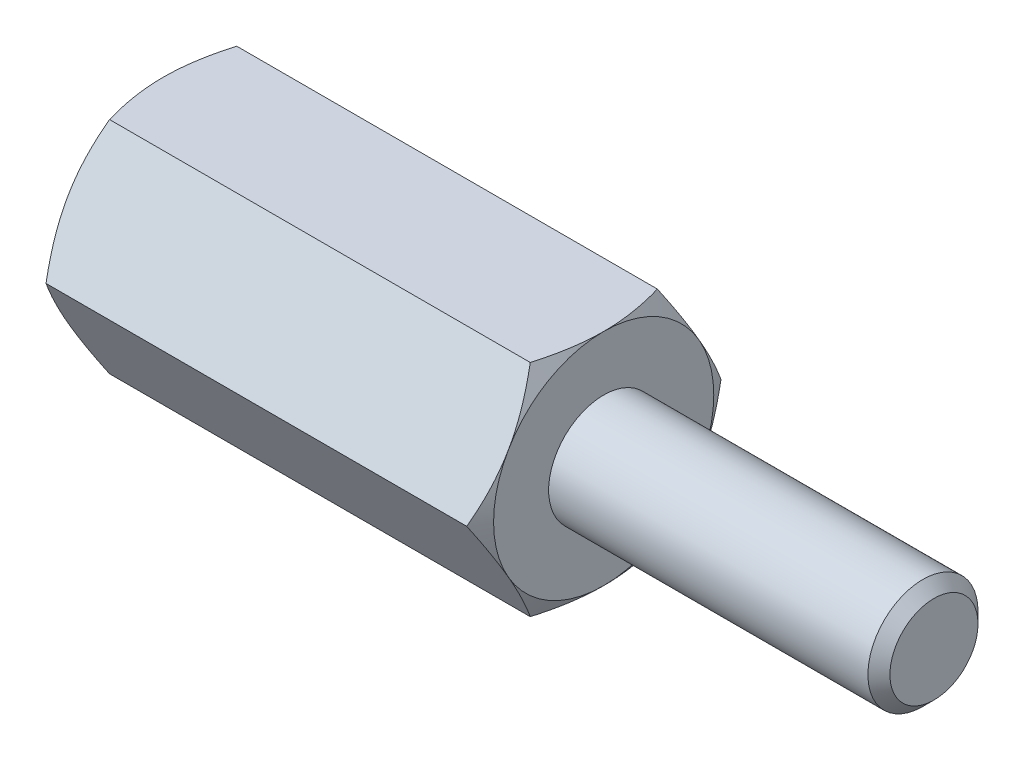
ISO-10303-21;
HEADER;
FILE_DESCRIPTION(('STEP AP214'),'2;1');
FILE_NAME('part.step','',(''),(''),'','','');
FILE_SCHEMA(('AUTOMOTIVE_DESIGN { 1 0 10303 214 1 1 1 1 }'));
ENDSEC;
DATA;
#1=APPLICATION_CONTEXT('core data for automotive mechanical design processes');
#2=APPLICATION_PROTOCOL_DEFINITION('international standard','automotive_design',2000,#1);
#3=PRODUCT_CONTEXT('',#1,'mechanical');
#4=PRODUCT('Part','Part','',(#3));
#5=PRODUCT_RELATED_PRODUCT_CATEGORY('part','',(#4));
#6=PRODUCT_DEFINITION_FORMATION('','',#4);
#7=PRODUCT_DEFINITION_CONTEXT('part definition',#1,'design');
#8=PRODUCT_DEFINITION('design','',#6,#7);
#9=PRODUCT_DEFINITION_SHAPE('','',#8);
#10=(LENGTH_UNIT() NAMED_UNIT(*) SI_UNIT(.MILLI.,.METRE.));
#11=(NAMED_UNIT(*) PLANE_ANGLE_UNIT() SI_UNIT($,.RADIAN.));
#12=(NAMED_UNIT(*) SI_UNIT($,.STERADIAN.) SOLID_ANGLE_UNIT());
#13=UNCERTAINTY_MEASURE_WITH_UNIT(LENGTH_MEASURE(1.E-05),#10,'distance_accuracy_value','');
#14=(GEOMETRIC_REPRESENTATION_CONTEXT(3) GLOBAL_UNCERTAINTY_ASSIGNED_CONTEXT((#13)) GLOBAL_UNIT_ASSIGNED_CONTEXT((#10,
#11,#12)) REPRESENTATION_CONTEXT('',''));
#15=CARTESIAN_POINT('',(0.,0.,0.));
#16=DIRECTION('',(0.,0.,1.));
#17=DIRECTION('',(1.,0.,0.));
#18=AXIS2_PLACEMENT_3D('',#15,#16,#17);
#19=CARTESIAN_POINT('',(4.,2.,-1.15470053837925));
#20=DIRECTION('',(1.,0.,0.));
#21=DIRECTION('',(0.,0.,-1.));
#22=AXIS2_PLACEMENT_3D('',#19,#20,#21);
#23=PLANE('',#22);
#24=CARTESIAN_POINT('',(4.,0.,0.));
#25=DIRECTION('',(1.,0.,0.));
#26=DIRECTION('',(0.,0.,-1.));
#27=AXIS2_PLACEMENT_3D('',#24,#25,#26);
#28=CIRCLE('',#27,2.);
#29=CARTESIAN_POINT('',(4.,-1.,-1.73205080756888));
#30=VERTEX_POINT('',#29);
#31=CARTESIAN_POINT('',(4.,1.,-1.73205080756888));
#32=VERTEX_POINT('',#31);
#33=EDGE_CURVE('E288',#30,#32,#28,.T.);
#34=ORIENTED_EDGE('',*,*,#33,.T.);
#35=CARTESIAN_POINT('',(4.,2.,0.));
#36=VERTEX_POINT('',#35);
#37=EDGE_CURVE('E53',#32,#36,#28,.T.);
#38=ORIENTED_EDGE('',*,*,#37,.T.);
#39=CARTESIAN_POINT('',(4.,1.,1.73205080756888));
#40=VERTEX_POINT('',#39);
#41=EDGE_CURVE('E297',#36,#40,#28,.T.);
#42=ORIENTED_EDGE('',*,*,#41,.T.);
#43=CARTESIAN_POINT('',(4.,-1.,1.73205080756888));
#44=VERTEX_POINT('',#43);
#45=EDGE_CURVE('E303',#40,#44,#28,.T.);
#46=ORIENTED_EDGE('',*,*,#45,.T.);
#47=CARTESIAN_POINT('',(4.,0.,0.));
#48=DIRECTION('',(-1.,0.,0.));
#49=DIRECTION('',(0.,-1.,0.));
#50=AXIS2_PLACEMENT_3D('',#47,#48,#49);
#51=CIRCLE('',#50,2.);
#52=CARTESIAN_POINT('',(4.,-2.,0.));
#53=VERTEX_POINT('',#52);
#54=EDGE_CURVE('E193',#53,#44,#51,.T.);
#55=ORIENTED_EDGE('',*,*,#54,.F.);
#56=EDGE_CURVE('E61',#53,#30,#28,.T.);
#57=ORIENTED_EDGE('',*,*,#56,.T.);
#58=EDGE_LOOP('',(#34,#38,#42,#46,#55,#57));
#59=FACE_BOUND('',#58,.T.);
#60=CARTESIAN_POINT('',(4.,0.,0.));
#61=DIRECTION('',(1.,0.,0.));
#62=DIRECTION('',(0.,0.,-1.));
#63=AXIS2_PLACEMENT_3D('',#60,#61,#62);
#64=CIRCLE('',#63,1.);
#65=CARTESIAN_POINT('',(4.,0.,-1.));
#66=VERTEX_POINT('',#65);
#67=EDGE_CURVE('E421',#66,#66,#64,.T.);
#68=ORIENTED_EDGE('',*,*,#67,.F.);
#69=EDGE_LOOP('',(#68));
#70=FACE_BOUND('',#69,.T.);
#71=ADVANCED_FACE('F37',(#59,#70),#23,.T.);
#72=CARTESIAN_POINT('',(4.,0.,-2.3094010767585));
#73=DIRECTION('',(0.,-0.5,0.866025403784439));
#74=DIRECTION('',(0.,-0.866025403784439,-0.5));
#75=AXIS2_PLACEMENT_3D('',#72,#73,#74);
#76=PLANE('',#75);
#77=CARTESIAN_POINT('',(3.8213005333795,-0.000200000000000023,-2.30951654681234));
#78=CARTESIAN_POINT('',(3.85061046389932,0.0876912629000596,-2.25877250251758));
#79=CARTESIAN_POINT('',(3.87726714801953,0.176341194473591,-2.20759044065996));
#80=CARTESIAN_POINT('',(3.92379750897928,0.355176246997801,-2.10433997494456));
#81=CARTESIAN_POINT('',(3.94365472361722,0.445364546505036,-2.05226973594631));
#82=CARTESIAN_POINT('',(3.97456653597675,0.624623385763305,-1.94877459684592));
#83=CARTESIAN_POINT('',(3.98582684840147,0.713666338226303,-1.89736562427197));
#84=CARTESIAN_POINT('',(3.99927133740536,0.892171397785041,-1.79430568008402));
#85=CARTESIAN_POINT('',(4.00146664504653,0.981632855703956,-1.74265508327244));
#86=CARTESIAN_POINT('',(3.99690901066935,1.1488083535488,-1.64613626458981));
#87=CARTESIAN_POINT('',(3.99127512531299,1.22654737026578,-1.60125362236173));
#88=CARTESIAN_POINT('',(3.97341610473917,1.38151891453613,-1.51178075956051));
#89=CARTESIAN_POINT('',(3.96118486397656,1.4587509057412,-1.46719084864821));
#90=CARTESIAN_POINT('',(3.93060656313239,1.6140421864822,-1.37753338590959));
#91=CARTESIAN_POINT('',(3.91212983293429,1.69208181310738,-1.33247718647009));
#92=CARTESIAN_POINT('',(3.87019448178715,1.84699686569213,-1.24303693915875));
#93=CARTESIAN_POINT('',(3.84674571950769,1.92387427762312,-1.1986517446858));
#94=CARTESIAN_POINT('',(3.8213005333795,2.0002,-1.15458506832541));
#95=B_SPLINE_CURVE_WITH_KNOTS('',3,(#77,#78,#79,#80,#81,#82,#83,#84,#85,#86,#87,#88,#89,#90,#91,
#92,#93,#94),.UNSPECIFIED.,.F.,.F.,(4,2,2,2,2,2,2,2,4),(0.,0.317031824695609,0.634825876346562,
0.944753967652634,1.25430138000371,1.52387047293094,1.79368946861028,2.06949491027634,
2.34475850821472),.UNSPECIFIED.);
#96=CARTESIAN_POINT('',(3.82136720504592,0.,-2.3094010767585));
#97=VERTEX_POINT('',#96);
#98=EDGE_CURVE('E357',#97,#32,#95,.T.);
#99=ORIENTED_EDGE('',*,*,#98,.F.);
#100=DIRECTION('',(-1.,0.,0.));
#101=VECTOR('',#100,1.);
#102=CARTESIAN_POINT('',(4.,0.,-2.3094010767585));
#103=LINE('',#102,#101);
#104=CARTESIAN_POINT('',(-3.82136720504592,0.,-2.3094010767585));
#105=VERTEX_POINT('',#104);
#106=EDGE_CURVE('E264',#97,#105,#103,.T.);
#107=ORIENTED_EDGE('',*,*,#106,.T.);
#108=CARTESIAN_POINT('',(-3.8213005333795,2.0002,-1.15458506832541));
#109=CARTESIAN_POINT('',(-3.85061046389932,1.91230873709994,-1.20532911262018));
#110=CARTESIAN_POINT('',(-3.87726714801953,1.82365880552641,-1.2565111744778));
#111=CARTESIAN_POINT('',(-3.92379750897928,1.6448237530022,-1.35976164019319));
#112=CARTESIAN_POINT('',(-3.94365472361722,1.55463545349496,-1.41183187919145));
#113=CARTESIAN_POINT('',(-3.97456653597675,1.37537661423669,-1.51532701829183));
#114=CARTESIAN_POINT('',(-3.98582684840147,1.2863336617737,-1.56673599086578));
#115=CARTESIAN_POINT('',(-3.99927133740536,1.10782860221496,-1.66979593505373));
#116=CARTESIAN_POINT('',(-4.00146664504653,1.01836714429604,-1.72144653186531));
#117=CARTESIAN_POINT('',(-3.99690901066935,0.851191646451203,-1.81796535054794));
#118=CARTESIAN_POINT('',(-3.99127512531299,0.773452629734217,-1.86284799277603));
#119=CARTESIAN_POINT('',(-3.97341610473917,0.618481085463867,-1.95232085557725));
#120=CARTESIAN_POINT('',(-3.96118486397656,0.541249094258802,-1.99691076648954));
#121=CARTESIAN_POINT('',(-3.93060656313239,0.3859578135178,-2.08656822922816));
#122=CARTESIAN_POINT('',(-3.91212983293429,0.307918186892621,-2.13162442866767));
#123=CARTESIAN_POINT('',(-3.87019448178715,0.153003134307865,-2.221064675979));
#124=CARTESIAN_POINT('',(-3.84674571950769,0.0761257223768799,-2.26544987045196));
#125=CARTESIAN_POINT('',(-3.8213005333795,-0.000200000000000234,-2.30951654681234));
#126=B_SPLINE_CURVE_WITH_KNOTS('',3,(#108,#109,#110,#111,#112,#113,#114,#115,#116,#117,#118,
#119,#120,#121,#122,#123,#124,#125),.UNSPECIFIED.,.F.,.F.,(4,2,2,2,2,2,2,2,4),(0.,
0.317031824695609,0.634825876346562,0.944753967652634,1.25430138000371,1.52387047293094,
1.79368946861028,2.06949491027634,2.34475850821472),.UNSPECIFIED.);
#127=CARTESIAN_POINT('',(-4.,1.,-1.73205080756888));
#128=VERTEX_POINT('',#127);
#129=EDGE_CURVE('E374',#128,#105,#126,.T.);
#130=ORIENTED_EDGE('',*,*,#129,.F.);
#131=CARTESIAN_POINT('',(-3.82136720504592,2.,-1.15470053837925));
#132=VERTEX_POINT('',#131);
#133=EDGE_CURVE('E373',#132,#128,#126,.T.);
#134=ORIENTED_EDGE('',*,*,#133,.F.);
#135=DIRECTION('',(-1.,0.,0.));
#136=VECTOR('',#135,1.);
#137=CARTESIAN_POINT('',(4.,2.,-1.15470053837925));
#138=LINE('',#137,#136);
#139=CARTESIAN_POINT('',(3.821367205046,2.,-1.15470053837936));
#140=VERTEX_POINT('',#139);
#141=EDGE_CURVE('E279',#140,#132,#138,.T.);
#142=ORIENTED_EDGE('',*,*,#141,.F.);
#143=EDGE_CURVE('E229',#32,#140,#95,.T.);
#144=ORIENTED_EDGE('',*,*,#143,.F.);
#145=EDGE_LOOP('',(#99,#107,#130,#134,#142,#144));
#146=FACE_BOUND('',#145,.T.);
#147=ADVANCED_FACE('F148',(#146),#76,.F.);
#148=CARTESIAN_POINT('',(4.,2.,-1.15470053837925));
#149=DIRECTION('',(0.,-1.,0.));
#150=DIRECTION('',(0.,0.,-1.));
#151=AXIS2_PLACEMENT_3D('',#148,#149,#150);
#152=PLANE('',#151);
#153=CARTESIAN_POINT('',(3.0041453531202,2.,-3.14239762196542));
#154=CARTESIAN_POINT('',(3.04685680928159,2.,-3.05468337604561));
#155=CARTESIAN_POINT('',(3.08917030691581,2.,-2.96677207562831));
#156=CARTESIAN_POINT('',(3.17277831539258,2.,-2.79045070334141));
#157=CARTESIAN_POINT('',(3.21407267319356,2.,-2.70204055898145));
#158=CARTESIAN_POINT('',(3.29561838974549,2.,-2.52418069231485));
#159=CARTESIAN_POINT('',(3.33586319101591,2.,-2.43472795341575));
#160=CARTESIAN_POINT('',(3.41475904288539,2.,-2.25512498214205));
#161=CARTESIAN_POINT('',(3.45341016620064,2.,-2.16497478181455));
#162=CARTESIAN_POINT('',(3.52996617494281,2.,-1.98078525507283));
#163=CARTESIAN_POINT('',(3.56780217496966,2.,-1.88671714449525));
#164=CARTESIAN_POINT('',(3.64070044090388,2.,-1.69751412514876));
#165=CARTESIAN_POINT('',(3.67576294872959,2.,-1.60237931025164));
#166=CARTESIAN_POINT('',(3.74223535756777,2.,-1.41102905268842));
#167=CARTESIAN_POINT('',(3.77365196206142,2.,-1.31481596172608));
#168=CARTESIAN_POINT('',(3.83184764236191,2.,-1.12101028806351));
#169=CARTESIAN_POINT('',(3.8586281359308,2.,-1.02341813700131));
#170=CARTESIAN_POINT('',(3.90615162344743,2.,-0.827336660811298));
#171=CARTESIAN_POINT('',(3.9269281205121,2.,-0.728855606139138));
#172=CARTESIAN_POINT('',(3.96129559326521,2.,-0.530628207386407));
#173=CARTESIAN_POINT('',(3.97488733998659,2.,-0.430882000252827));
#174=CARTESIAN_POINT('',(3.99362159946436,2.,-0.231937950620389));
#175=CARTESIAN_POINT('',(3.99887592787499,2.,-0.132750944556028));
#176=CARTESIAN_POINT('',(4.00079968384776,2.,0.0657049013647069));
#177=CARTESIAN_POINT('',(3.9974689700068,2.,0.164973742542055));
#178=CARTESIAN_POINT('',(3.97965125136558,2.,0.400692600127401));
#179=CARTESIAN_POINT('',(3.96138848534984,2.,0.536859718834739));
#180=CARTESIAN_POINT('',(3.91179958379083,2.,0.806792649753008));
#181=CARTESIAN_POINT('',(3.88046153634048,2.,0.9405561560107));
#182=CARTESIAN_POINT('',(3.80733694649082,2.,1.20849227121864));
#183=CARTESIAN_POINT('',(3.76532316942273,2.,1.34260127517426));
#184=CARTESIAN_POINT('',(3.69701155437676,2.,1.54188460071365));
#185=CARTESIAN_POINT('',(3.67336125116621,2.,1.60799390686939));
#186=CARTESIAN_POINT('',(3.62457310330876,2.,1.73966131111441));
#187=CARTESIAN_POINT('',(3.59943529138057,2.,1.80521942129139));
#188=CARTESIAN_POINT('',(3.53045244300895,2.,1.98014362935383));
#189=CARTESIAN_POINT('',(3.48548288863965,2.,2.08906517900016));
#190=CARTESIAN_POINT('',(3.39293953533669,2.,2.3058004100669));
#191=CARTESIAN_POINT('',(3.34536546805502,2.,2.41361397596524));
#192=CARTESIAN_POINT('',(3.24822629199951,2.,2.62838132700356));
#193=CARTESIAN_POINT('',(3.19866051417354,2.,2.7353348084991));
#194=CARTESIAN_POINT('',(3.09800140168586,2.,2.94852186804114));
#195=CARTESIAN_POINT('',(3.04690802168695,2.,3.05475542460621));
#196=CARTESIAN_POINT('',(2.89169615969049,2.,3.37291303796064));
#197=CARTESIAN_POINT('',(2.78579652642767,2.,3.58396705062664));
#198=CARTESIAN_POINT('',(2.57100981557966,2.,4.00448363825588));
#199=CARTESIAN_POINT('',(2.46212334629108,2.,4.21394652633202));
#200=CARTESIAN_POINT('',(2.25376773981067,2.,4.61000648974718));
#201=CARTESIAN_POINT('',(2.15450073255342,2.,4.79671008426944));
#202=CARTESIAN_POINT('',(1.95476413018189,2.,5.16948614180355));
#203=CARTESIAN_POINT('',(1.85429446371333,2.,5.35555856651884));
#204=CARTESIAN_POINT('',(1.6527937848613,2.,5.72660635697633));
#205=CARTESIAN_POINT('',(1.55176570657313,2.,5.9115833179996));
#206=CARTESIAN_POINT('',(1.34902395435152,2.,6.28114276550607));
#207=CARTESIAN_POINT('',(1.24731033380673,2.,6.46572528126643));
#208=CARTESIAN_POINT('',(1.14534707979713,2.,6.65016883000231));
#209=B_SPLINE_CURVE_WITH_KNOTS('',3,(#153,#154,#155,#156,#157,#158,#159,#160,#161,#162,#163,
#164,#165,#166,#167,#168,#169,#170,#171,#172,#173,#174,#175,#176,#177,#178,#179,#180,#181,#182,
#183,#184,#185,#186,#187,#188,#189,#190,#191,#192,#193,#194,#195,#196,#197,#198,#199,#200,#201,
#202,#203,#204,#205,#206,#207,#208),.UNSPECIFIED.,.F.,.F.,(4,2,2,2,2,2,2,2,2,2,2,2,2,2,2,2,2,2,
2,2,2,2,2,2,2,2,2,4),(0.,0.292684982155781,0.585413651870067,0.879667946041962,1.17390879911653,
1.47805164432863,1.78216793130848,2.08571589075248,2.38917085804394,2.690898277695,
2.99259331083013,3.29020694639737,3.58782548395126,3.99913738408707,4.41082482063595,
4.8321411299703,5.0427662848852,5.25338680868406,5.6068563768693,5.96036243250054,
6.31398824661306,6.66762456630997,7.37597688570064,8.08418599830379,8.71853756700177,
9.35292696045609,9.98522933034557,10.6174830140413),.UNSPECIFIED.);
#210=EDGE_CURVE('E227',#140,#36,#209,.T.);
#211=ORIENTED_EDGE('',*,*,#210,.F.);
#212=ORIENTED_EDGE('',*,*,#141,.T.);
#213=CARTESIAN_POINT('',(-3.0041453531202,2.,-3.14239762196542));
#214=CARTESIAN_POINT('',(-3.04685680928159,2.,-3.05468337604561));
#215=CARTESIAN_POINT('',(-3.08917030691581,2.,-2.96677207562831));
#216=CARTESIAN_POINT('',(-3.17277831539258,2.,-2.79045070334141));
#217=CARTESIAN_POINT('',(-3.21407267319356,2.,-2.70204055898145));
#218=CARTESIAN_POINT('',(-3.29561838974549,2.,-2.52418069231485));
#219=CARTESIAN_POINT('',(-3.33586319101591,2.,-2.43472795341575));
#220=CARTESIAN_POINT('',(-3.41475904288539,2.,-2.25512498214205));
#221=CARTESIAN_POINT('',(-3.45341016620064,2.,-2.16497478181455));
#222=CARTESIAN_POINT('',(-3.52996617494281,2.,-1.98078525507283));
#223=CARTESIAN_POINT('',(-3.56780217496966,2.,-1.88671714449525));
#224=CARTESIAN_POINT('',(-3.64070044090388,2.,-1.69751412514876));
#225=CARTESIAN_POINT('',(-3.67576294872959,2.,-1.60237931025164));
#226=CARTESIAN_POINT('',(-3.74223535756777,2.,-1.41102905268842));
#227=CARTESIAN_POINT('',(-3.77365196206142,2.,-1.31481596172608));
#228=CARTESIAN_POINT('',(-3.83184764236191,2.,-1.12101028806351));
#229=CARTESIAN_POINT('',(-3.8586281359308,2.,-1.02341813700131));
#230=CARTESIAN_POINT('',(-3.90615162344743,2.,-0.827336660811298));
#231=CARTESIAN_POINT('',(-3.9269281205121,2.,-0.728855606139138));
#232=CARTESIAN_POINT('',(-3.96129559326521,2.,-0.530628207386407));
#233=CARTESIAN_POINT('',(-3.97488733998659,2.,-0.430882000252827));
#234=CARTESIAN_POINT('',(-3.99362159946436,2.,-0.231937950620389));
#235=CARTESIAN_POINT('',(-3.99887592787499,2.,-0.132750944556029));
#236=CARTESIAN_POINT('',(-4.00079968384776,2.,0.0657049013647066));
#237=CARTESIAN_POINT('',(-3.9974689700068,2.,0.164973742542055));
#238=CARTESIAN_POINT('',(-3.97965125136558,2.,0.400692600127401));
#239=CARTESIAN_POINT('',(-3.96138848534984,2.,0.536859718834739));
#240=CARTESIAN_POINT('',(-3.91179958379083,2.,0.806792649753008));
#241=CARTESIAN_POINT('',(-3.88046153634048,2.,0.940556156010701));
#242=CARTESIAN_POINT('',(-3.80733694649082,2.,1.20849227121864));
#243=CARTESIAN_POINT('',(-3.76532316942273,2.,1.34260127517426));
#244=CARTESIAN_POINT('',(-3.69701155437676,2.,1.54188460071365));
#245=CARTESIAN_POINT('',(-3.67336125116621,2.,1.6079939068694));
#246=CARTESIAN_POINT('',(-3.62457310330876,2.,1.73966131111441));
#247=CARTESIAN_POINT('',(-3.59943529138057,2.,1.80521942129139));
#248=CARTESIAN_POINT('',(-3.53045244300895,2.,1.98014362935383));
#249=CARTESIAN_POINT('',(-3.48548288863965,2.,2.08906517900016));
#250=CARTESIAN_POINT('',(-3.39293953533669,2.,2.3058004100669));
#251=CARTESIAN_POINT('',(-3.34536546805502,2.,2.41361397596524));
#252=CARTESIAN_POINT('',(-3.24822629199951,2.,2.62838132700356));
#253=CARTESIAN_POINT('',(-3.19866051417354,2.,2.7353348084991));
#254=CARTESIAN_POINT('',(-3.09800140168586,2.,2.94852186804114));
#255=CARTESIAN_POINT('',(-3.04690802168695,2.,3.05475542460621));
#256=CARTESIAN_POINT('',(-2.89169615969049,2.,3.37291303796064));
#257=CARTESIAN_POINT('',(-2.78579652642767,2.,3.58396705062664));
#258=CARTESIAN_POINT('',(-2.57100981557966,2.,4.00448363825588));
#259=CARTESIAN_POINT('',(-2.46212334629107,2.,4.21394652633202));
#260=CARTESIAN_POINT('',(-2.25376773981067,2.,4.61000648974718));
#261=CARTESIAN_POINT('',(-2.15450073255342,2.,4.79671008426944));
#262=CARTESIAN_POINT('',(-1.95476413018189,2.,5.16948614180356));
#263=CARTESIAN_POINT('',(-1.85429446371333,2.,5.35555856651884));
#264=CARTESIAN_POINT('',(-1.6527937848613,2.,5.72660635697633));
#265=CARTESIAN_POINT('',(-1.55176570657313,2.,5.9115833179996));
#266=CARTESIAN_POINT('',(-1.34902395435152,2.,6.28114276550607));
#267=CARTESIAN_POINT('',(-1.24731033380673,2.,6.46572528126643));
#268=CARTESIAN_POINT('',(-1.14534707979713,2.,6.65016883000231));
#269=B_SPLINE_CURVE_WITH_KNOTS('',3,(#213,#214,#215,#216,#217,#218,#219,#220,#221,#222,#223,
#224,#225,#226,#227,#228,#229,#230,#231,#232,#233,#234,#235,#236,#237,#238,#239,#240,#241,#242,
#243,#244,#245,#246,#247,#248,#249,#250,#251,#252,#253,#254,#255,#256,#257,#258,#259,#260,#261,
#262,#263,#264,#265,#266,#267,#268),.UNSPECIFIED.,.F.,.F.,(4,2,2,2,2,2,2,2,2,2,2,2,2,2,2,2,2,2,
2,2,2,2,2,2,2,2,2,4),(0.,0.292684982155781,0.585413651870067,0.879667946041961,1.17390879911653,
1.47805164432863,1.78216793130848,2.08571589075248,2.38917085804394,2.690898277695,
2.99259331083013,3.29020694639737,3.58782548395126,3.99913738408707,4.41082482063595,
4.8321411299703,5.0427662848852,5.25338680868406,5.60685637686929,5.96036243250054,
6.31398824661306,6.66762456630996,7.37597688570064,8.08418599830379,8.71853756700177,
9.3529269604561,9.98522933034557,10.6174830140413),.UNSPECIFIED.);
#270=CARTESIAN_POINT('',(-4.,2.,0.));
#271=VERTEX_POINT('',#270);
#272=EDGE_CURVE('E241',#271,#132,#269,.F.);
#273=ORIENTED_EDGE('',*,*,#272,.F.);
#274=CARTESIAN_POINT('',(-3.82136720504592,2.,1.15470053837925));
#275=VERTEX_POINT('',#274);
#276=EDGE_CURVE('E249',#275,#271,#269,.F.);
#277=ORIENTED_EDGE('',*,*,#276,.F.);
#278=DIRECTION('',(-1.,0.,0.));
#279=VECTOR('',#278,1.);
#280=CARTESIAN_POINT('',(4.,2.,1.15470053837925));
#281=LINE('',#280,#279);
#282=CARTESIAN_POINT('',(3.82136720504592,2.,1.15470053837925));
#283=VERTEX_POINT('',#282);
#284=EDGE_CURVE('E276',#283,#275,#281,.T.);
#285=ORIENTED_EDGE('',*,*,#284,.F.);
#286=EDGE_CURVE('E221',#36,#283,#209,.T.);
#287=ORIENTED_EDGE('',*,*,#286,.F.);
#288=EDGE_LOOP('',(#211,#212,#273,#277,#285,#287));
#289=FACE_BOUND('',#288,.T.);
#290=ADVANCED_FACE('F153',(#289),#152,.F.);
#291=CARTESIAN_POINT('',(4.,2.,1.15470053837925));
#292=DIRECTION('',(0.,-0.5,-0.866025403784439));
#293=DIRECTION('',(0.,0.866025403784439,-0.5));
#294=AXIS2_PLACEMENT_3D('',#291,#292,#293);
#295=PLANE('',#294);
#296=CARTESIAN_POINT('',(3.8213005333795,2.0002,1.15458506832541));
#297=CARTESIAN_POINT('',(3.85061046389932,1.91230873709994,1.20532911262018));
#298=CARTESIAN_POINT('',(3.87726714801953,1.82365880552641,1.2565111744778));
#299=CARTESIAN_POINT('',(3.92379750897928,1.6448237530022,1.35976164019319));
#300=CARTESIAN_POINT('',(3.94365472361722,1.55463545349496,1.41183187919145));
#301=CARTESIAN_POINT('',(3.97456653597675,1.37537661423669,1.51532701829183));
#302=CARTESIAN_POINT('',(3.98582684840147,1.2863336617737,1.56673599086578));
#303=CARTESIAN_POINT('',(3.99927133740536,1.10782860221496,1.66979593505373));
#304=CARTESIAN_POINT('',(4.00146664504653,1.01836714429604,1.72144653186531));
#305=CARTESIAN_POINT('',(3.99690901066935,0.851191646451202,1.81796535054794));
#306=CARTESIAN_POINT('',(3.99127512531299,0.773452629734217,1.86284799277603));
#307=CARTESIAN_POINT('',(3.97341610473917,0.618481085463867,1.95232085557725));
#308=CARTESIAN_POINT('',(3.96118486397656,0.541249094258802,1.99691076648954));
#309=CARTESIAN_POINT('',(3.93060656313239,0.3859578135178,2.08656822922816));
#310=CARTESIAN_POINT('',(3.91212983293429,0.307918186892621,2.13162442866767));
#311=CARTESIAN_POINT('',(3.87019448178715,0.153003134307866,2.221064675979));
#312=CARTESIAN_POINT('',(3.84674571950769,0.0761257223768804,2.26544987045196));
#313=CARTESIAN_POINT('',(3.8213005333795,-0.000199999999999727,2.30951654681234));
#314=B_SPLINE_CURVE_WITH_KNOTS('',3,(#296,#297,#298,#299,#300,#301,#302,#303,#304,#305,#306,
#307,#308,#309,#310,#311,#312,#313),.UNSPECIFIED.,.F.,.F.,(4,2,2,2,2,2,2,2,4),(0.,
0.31703182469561,0.634825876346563,0.944753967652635,1.25430138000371,1.52387047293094,
1.79368946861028,2.06949491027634,2.34475850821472),.UNSPECIFIED.);
#315=EDGE_CURVE('E228',#283,#40,#314,.T.);
#316=ORIENTED_EDGE('',*,*,#315,.F.);
#317=ORIENTED_EDGE('',*,*,#284,.T.);
#318=CARTESIAN_POINT('',(-3.8213005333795,-0.000199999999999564,2.30951654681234));
#319=CARTESIAN_POINT('',(-3.85061046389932,0.0876912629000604,2.25877250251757));
#320=CARTESIAN_POINT('',(-3.87726714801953,0.176341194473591,2.20759044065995));
#321=CARTESIAN_POINT('',(-3.92379750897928,0.355176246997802,2.10433997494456));
#322=CARTESIAN_POINT('',(-3.94365472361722,0.445364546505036,2.0522697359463));
#323=CARTESIAN_POINT('',(-3.97456653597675,0.624623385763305,1.94877459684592));
#324=CARTESIAN_POINT('',(-3.98582684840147,0.713666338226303,1.89736562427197));
#325=CARTESIAN_POINT('',(-3.99927133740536,0.892171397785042,1.79430568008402));
#326=CARTESIAN_POINT('',(-4.00146664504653,0.981632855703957,1.74265508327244));
#327=CARTESIAN_POINT('',(-3.99690901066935,1.1488083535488,1.64613626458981));
#328=CARTESIAN_POINT('',(-3.99127512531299,1.22654737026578,1.60125362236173));
#329=CARTESIAN_POINT('',(-3.97341610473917,1.38151891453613,1.51178075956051));
#330=CARTESIAN_POINT('',(-3.96118486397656,1.4587509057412,1.46719084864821));
#331=CARTESIAN_POINT('',(-3.93060656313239,1.6140421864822,1.37753338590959));
#332=CARTESIAN_POINT('',(-3.91212983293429,1.69208181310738,1.33247718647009));
#333=CARTESIAN_POINT('',(-3.87019448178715,1.84699686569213,1.24303693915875));
#334=CARTESIAN_POINT('',(-3.84674571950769,1.92387427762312,1.1986517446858));
#335=CARTESIAN_POINT('',(-3.8213005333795,2.0002,1.15458506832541));
#336=B_SPLINE_CURVE_WITH_KNOTS('',3,(#318,#319,#320,#321,#322,#323,#324,#325,#326,#327,#328,
#329,#330,#331,#332,#333,#334,#335),.UNSPECIFIED.,.F.,.F.,(4,2,2,2,2,2,2,2,4),(0.,
0.317031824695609,0.634825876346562,0.944753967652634,1.25430138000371,1.52387047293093,
1.79368946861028,2.06949491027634,2.34475850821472),.UNSPECIFIED.);
#337=CARTESIAN_POINT('',(-4.,1.,1.73205080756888));
#338=VERTEX_POINT('',#337);
#339=EDGE_CURVE('E255',#338,#275,#336,.T.);
#340=ORIENTED_EDGE('',*,*,#339,.F.);
#341=CARTESIAN_POINT('',(-3.82136720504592,0.,2.3094010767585));
#342=VERTEX_POINT('',#341);
#343=EDGE_CURVE('E262',#342,#338,#336,.T.);
#344=ORIENTED_EDGE('',*,*,#343,.F.);
#345=DIRECTION('',(-1.,0.,0.));
#346=VECTOR('',#345,1.);
#347=CARTESIAN_POINT('',(4.,0.,2.3094010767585));
#348=LINE('',#347,#346);
#349=CARTESIAN_POINT('',(3.82136720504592,0.,2.3094010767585));
#350=VERTEX_POINT('',#349);
#351=EDGE_CURVE('E273',#350,#342,#348,.T.);
#352=ORIENTED_EDGE('',*,*,#351,.F.);
#353=EDGE_CURVE('E215',#40,#350,#314,.T.);
#354=ORIENTED_EDGE('',*,*,#353,.F.);
#355=EDGE_LOOP('',(#316,#317,#340,#344,#352,#354));
#356=FACE_BOUND('',#355,.T.);
#357=ADVANCED_FACE('F235',(#356),#295,.F.);
#358=CARTESIAN_POINT('',(4.,0.,2.3094010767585));
#359=DIRECTION('',(0.,0.5,-0.866025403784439));
#360=DIRECTION('',(0.,0.866025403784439,0.5));
#361=AXIS2_PLACEMENT_3D('',#358,#359,#360);
#362=PLANE('',#361);
#363=CARTESIAN_POINT('',(3.8213005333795,0.000200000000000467,2.30951654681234));
#364=CARTESIAN_POINT('',(3.85061046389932,-0.0876912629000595,2.25877250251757));
#365=CARTESIAN_POINT('',(3.87726714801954,-0.176341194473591,2.20759044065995));
#366=CARTESIAN_POINT('',(3.92379750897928,-0.355176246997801,2.10433997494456));
#367=CARTESIAN_POINT('',(3.94365472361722,-0.445364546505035,2.0522697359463));
#368=CARTESIAN_POINT('',(3.97456653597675,-0.624623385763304,1.94877459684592));
#369=CARTESIAN_POINT('',(3.98582684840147,-0.713666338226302,1.89736562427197));
#370=CARTESIAN_POINT('',(3.99927133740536,-0.892171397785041,1.79430568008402));
#371=CARTESIAN_POINT('',(4.00146664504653,-0.981632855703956,1.74265508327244));
#372=CARTESIAN_POINT('',(3.99690901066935,-1.1488083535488,1.64613626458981));
#373=CARTESIAN_POINT('',(3.99127512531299,-1.22654737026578,1.60125362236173));
#374=CARTESIAN_POINT('',(3.97341610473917,-1.38151891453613,1.51178075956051));
#375=CARTESIAN_POINT('',(3.96118486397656,-1.4587509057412,1.46719084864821));
#376=CARTESIAN_POINT('',(3.93060656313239,-1.6140421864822,1.37753338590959));
#377=CARTESIAN_POINT('',(3.91212983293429,-1.69208181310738,1.33247718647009));
#378=CARTESIAN_POINT('',(3.87019448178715,-1.84699686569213,1.24303693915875));
#379=CARTESIAN_POINT('',(3.84674571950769,-1.92387427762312,1.1986517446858));
#380=CARTESIAN_POINT('',(3.8213005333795,-2.0002,1.15458506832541));
#381=B_SPLINE_CURVE_WITH_KNOTS('',3,(#363,#364,#365,#366,#367,#368,#369,#370,#371,#372,#373,
#374,#375,#376,#377,#378,#379,#380),.UNSPECIFIED.,.F.,.F.,(4,2,2,2,2,2,2,2,4),(0.,
0.31703182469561,0.634825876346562,0.944753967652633,1.25430138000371,1.52387047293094,
1.79368946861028,2.06949491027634,2.34475850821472),.UNSPECIFIED.);
#382=EDGE_CURVE('E318',#350,#44,#381,.T.);
#383=ORIENTED_EDGE('',*,*,#382,.F.);
#384=ORIENTED_EDGE('',*,*,#351,.T.);
#385=CARTESIAN_POINT('',(-3.8213005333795,-2.0002,1.15458506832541));
#386=CARTESIAN_POINT('',(-3.85061046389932,-1.91230873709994,1.20532911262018));
#387=CARTESIAN_POINT('',(-3.87726714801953,-1.82365880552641,1.2565111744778));
#388=CARTESIAN_POINT('',(-3.92379750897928,-1.6448237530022,1.35976164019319));
#389=CARTESIAN_POINT('',(-3.94365472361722,-1.55463545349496,1.41183187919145));
#390=CARTESIAN_POINT('',(-3.97456653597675,-1.3753766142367,1.51532701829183));
#391=CARTESIAN_POINT('',(-3.98582684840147,-1.2863336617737,1.56673599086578));
#392=CARTESIAN_POINT('',(-3.99927133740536,-1.10782860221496,1.66979593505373));
#393=CARTESIAN_POINT('',(-4.00146664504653,-1.01836714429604,1.72144653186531));
#394=CARTESIAN_POINT('',(-3.99690901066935,-0.851191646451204,1.81796535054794));
#395=CARTESIAN_POINT('',(-3.99127512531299,-0.773452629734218,1.86284799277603));
#396=CARTESIAN_POINT('',(-3.97341610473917,-0.618481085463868,1.95232085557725));
#397=CARTESIAN_POINT('',(-3.96118486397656,-0.541249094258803,1.99691076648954));
#398=CARTESIAN_POINT('',(-3.93060656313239,-0.3859578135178,2.08656822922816));
#399=CARTESIAN_POINT('',(-3.91212983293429,-0.307918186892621,2.13162442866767));
#400=CARTESIAN_POINT('',(-3.87019448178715,-0.153003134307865,2.221064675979));
#401=CARTESIAN_POINT('',(-3.84674571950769,-0.0761257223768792,2.26544987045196));
#402=CARTESIAN_POINT('',(-3.8213005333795,0.000200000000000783,2.30951654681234));
#403=B_SPLINE_CURVE_WITH_KNOTS('',3,(#385,#386,#387,#388,#389,#390,#391,#392,#393,#394,#395,
#396,#397,#398,#399,#400,#401,#402),.UNSPECIFIED.,.F.,.F.,(4,2,2,2,2,2,2,2,4),(0.,
0.317031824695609,0.634825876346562,0.944753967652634,1.25430138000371,1.52387047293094,
1.79368946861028,2.06949491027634,2.34475850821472),.UNSPECIFIED.);
#404=CARTESIAN_POINT('',(-4.,-1.,1.73205080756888));
#405=VERTEX_POINT('',#404);
#406=EDGE_CURVE('E263',#405,#342,#403,.T.);
#407=ORIENTED_EDGE('',*,*,#406,.F.);
#408=CARTESIAN_POINT('',(-3.82136720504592,-2.,1.15470053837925));
#409=VERTEX_POINT('',#408);
#410=EDGE_CURVE('E250',#409,#405,#403,.T.);
#411=ORIENTED_EDGE('',*,*,#410,.F.);
#412=DIRECTION('',(-1.,0.,0.));
#413=VECTOR('',#412,1.);
#414=CARTESIAN_POINT('',(4.,-2.,1.15470053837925));
#415=LINE('',#414,#413);
#416=CARTESIAN_POINT('',(3.82136720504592,-2.,1.15470053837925));
#417=VERTEX_POINT('',#416);
#418=EDGE_CURVE('E270',#417,#409,#415,.T.);
#419=ORIENTED_EDGE('',*,*,#418,.F.);
#420=EDGE_CURVE('E210',#44,#417,#381,.T.);
#421=ORIENTED_EDGE('',*,*,#420,.F.);
#422=EDGE_LOOP('',(#383,#384,#407,#411,#419,#421));
#423=FACE_BOUND('',#422,.T.);
#424=ADVANCED_FACE('F404',(#423),#362,.F.);
#425=CARTESIAN_POINT('',(4.,-2.,1.15470053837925));
#426=DIRECTION('',(0.,1.,0.));
#427=DIRECTION('',(0.,0.,1.));
#428=AXIS2_PLACEMENT_3D('',#425,#426,#427);
#429=PLANE('',#428);
#430=CARTESIAN_POINT('',(3.0041453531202,-2.,-3.14239762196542));
#431=CARTESIAN_POINT('',(3.04685680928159,-2.,-3.05468337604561));
#432=CARTESIAN_POINT('',(3.08917030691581,-2.,-2.96677207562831));
#433=CARTESIAN_POINT('',(3.17277831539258,-2.,-2.79045070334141));
#434=CARTESIAN_POINT('',(3.21407267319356,-2.,-2.70204055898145));
#435=CARTESIAN_POINT('',(3.29561838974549,-2.,-2.52418069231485));
#436=CARTESIAN_POINT('',(3.33586319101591,-2.,-2.43472795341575));
#437=CARTESIAN_POINT('',(3.41475904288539,-2.,-2.25512498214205));
#438=CARTESIAN_POINT('',(3.45341016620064,-2.,-2.16497478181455));
#439=CARTESIAN_POINT('',(3.52996617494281,-2.,-1.98078525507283));
#440=CARTESIAN_POINT('',(3.56780217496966,-2.,-1.88671714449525));
#441=CARTESIAN_POINT('',(3.64070044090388,-2.,-1.69751412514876));
#442=CARTESIAN_POINT('',(3.67576294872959,-2.,-1.60237931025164));
#443=CARTESIAN_POINT('',(3.74223535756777,-2.,-1.41102905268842));
#444=CARTESIAN_POINT('',(3.77365196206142,-2.,-1.31481596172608));
#445=CARTESIAN_POINT('',(3.83184764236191,-2.,-1.12101028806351));
#446=CARTESIAN_POINT('',(3.8586281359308,-2.,-1.02341813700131));
#447=CARTESIAN_POINT('',(3.90615162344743,-2.,-0.827336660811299));
#448=CARTESIAN_POINT('',(3.9269281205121,-2.,-0.728855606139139));
#449=CARTESIAN_POINT('',(3.96129559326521,-2.,-0.530628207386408));
#450=CARTESIAN_POINT('',(3.97488733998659,-2.,-0.430882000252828));
#451=CARTESIAN_POINT('',(3.99362159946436,-2.,-0.231937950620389));
#452=CARTESIAN_POINT('',(3.99887592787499,-2.,-0.132750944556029));
#453=CARTESIAN_POINT('',(4.00079968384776,-2.,0.0657049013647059));
#454=CARTESIAN_POINT('',(3.9974689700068,-2.,0.164973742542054));
#455=CARTESIAN_POINT('',(3.97965125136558,-2.,0.4006926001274));
#456=CARTESIAN_POINT('',(3.96138848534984,-2.,0.536859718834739));
#457=CARTESIAN_POINT('',(3.91179958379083,-2.,0.806792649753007));
#458=CARTESIAN_POINT('',(3.88046153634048,-2.,0.940556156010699));
#459=CARTESIAN_POINT('',(3.80733694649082,-2.,1.20849227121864));
#460=CARTESIAN_POINT('',(3.76532316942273,-2.,1.34260127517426));
#461=CARTESIAN_POINT('',(3.69701155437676,-2.,1.54188460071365));
#462=CARTESIAN_POINT('',(3.67336125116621,-2.,1.60799390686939));
#463=CARTESIAN_POINT('',(3.62457310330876,-2.,1.73966131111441));
#464=CARTESIAN_POINT('',(3.59943529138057,-2.,1.80521942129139));
#465=CARTESIAN_POINT('',(3.53045244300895,-2.,1.98014362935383));
#466=CARTESIAN_POINT('',(3.48548288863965,-2.,2.08906517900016));
#467=CARTESIAN_POINT('',(3.39293953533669,-2.,2.3058004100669));
#468=CARTESIAN_POINT('',(3.34536546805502,-2.,2.41361397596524));
#469=CARTESIAN_POINT('',(3.24822629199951,-2.,2.62838132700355));
#470=CARTESIAN_POINT('',(3.19866051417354,-2.,2.7353348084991));
#471=CARTESIAN_POINT('',(3.09800140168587,-2.,2.94852186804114));
#472=CARTESIAN_POINT('',(3.04690802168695,-2.,3.05475542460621));
#473=CARTESIAN_POINT('',(2.89169615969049,-2.,3.37291303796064));
#474=CARTESIAN_POINT('',(2.78579652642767,-2.,3.58396705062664));
#475=CARTESIAN_POINT('',(2.57100981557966,-2.,4.00448363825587));
#476=CARTESIAN_POINT('',(2.46212334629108,-2.,4.21394652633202));
#477=CARTESIAN_POINT('',(2.25376773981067,-2.,4.61000648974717));
#478=CARTESIAN_POINT('',(2.15450073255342,-2.,4.79671008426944));
#479=CARTESIAN_POINT('',(1.9547641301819,-2.,5.16948614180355));
#480=CARTESIAN_POINT('',(1.85429446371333,-2.,5.35555856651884));
#481=CARTESIAN_POINT('',(1.6527937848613,-2.,5.72660635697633));
#482=CARTESIAN_POINT('',(1.55176570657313,-2.,5.9115833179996));
#483=CARTESIAN_POINT('',(1.34902395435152,-2.,6.28114276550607));
#484=CARTESIAN_POINT('',(1.24731033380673,-2.,6.46572528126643));
#485=CARTESIAN_POINT('',(1.14534707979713,-2.,6.6501688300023));
#486=B_SPLINE_CURVE_WITH_KNOTS('',3,(#430,#431,#432,#433,#434,#435,#436,#437,#438,#439,#440,
#441,#442,#443,#444,#445,#446,#447,#448,#449,#450,#451,#452,#453,#454,#455,#456,#457,#458,#459,
#460,#461,#462,#463,#464,#465,#466,#467,#468,#469,#470,#471,#472,#473,#474,#475,#476,#477,#478,
#479,#480,#481,#482,#483,#484,#485),.UNSPECIFIED.,.F.,.F.,(4,2,2,2,2,2,2,2,2,2,2,2,2,2,2,2,2,2,
2,2,2,2,2,2,2,2,2,4),(0.,0.292684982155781,0.585413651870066,0.879667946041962,1.17390879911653,
1.47805164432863,1.78216793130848,2.08571589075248,2.38917085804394,2.690898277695,
2.99259331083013,3.29020694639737,3.58782548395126,3.99913738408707,4.41082482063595,
4.83214112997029,5.0427662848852,5.25338680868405,5.60685637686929,5.96036243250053,
6.31398824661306,6.66762456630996,7.37597688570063,8.08418599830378,8.71853756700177,
9.35292696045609,9.98522933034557,10.6174830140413),.UNSPECIFIED.);
#487=EDGE_CURVE('E319',#417,#53,#486,.F.);
#488=ORIENTED_EDGE('',*,*,#487,.F.);
#489=ORIENTED_EDGE('',*,*,#418,.T.);
#490=CARTESIAN_POINT('',(-3.0041453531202,-2.,-3.14239762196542));
#491=CARTESIAN_POINT('',(-3.04685680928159,-2.,-3.05468337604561));
#492=CARTESIAN_POINT('',(-3.08917030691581,-2.,-2.96677207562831));
#493=CARTESIAN_POINT('',(-3.17277831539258,-2.,-2.79045070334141));
#494=CARTESIAN_POINT('',(-3.21407267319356,-2.,-2.70204055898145));
#495=CARTESIAN_POINT('',(-3.29561838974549,-2.,-2.52418069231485));
#496=CARTESIAN_POINT('',(-3.33586319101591,-2.,-2.43472795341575));
#497=CARTESIAN_POINT('',(-3.41475904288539,-2.,-2.25512498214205));
#498=CARTESIAN_POINT('',(-3.45341016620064,-2.,-2.16497478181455));
#499=CARTESIAN_POINT('',(-3.52996617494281,-2.,-1.98078525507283));
#500=CARTESIAN_POINT('',(-3.56780217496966,-2.,-1.88671714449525));
#501=CARTESIAN_POINT('',(-3.64070044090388,-2.,-1.69751412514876));
#502=CARTESIAN_POINT('',(-3.67576294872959,-2.,-1.60237931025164));
#503=CARTESIAN_POINT('',(-3.74223535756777,-2.,-1.41102905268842));
#504=CARTESIAN_POINT('',(-3.77365196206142,-2.,-1.31481596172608));
#505=CARTESIAN_POINT('',(-3.83184764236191,-2.,-1.12101028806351));
#506=CARTESIAN_POINT('',(-3.8586281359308,-2.,-1.02341813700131));
#507=CARTESIAN_POINT('',(-3.90615162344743,-2.,-0.827336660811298));
#508=CARTESIAN_POINT('',(-3.9269281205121,-2.,-0.728855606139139));
#509=CARTESIAN_POINT('',(-3.96129559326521,-2.,-0.530628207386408));
#510=CARTESIAN_POINT('',(-3.97488733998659,-2.,-0.430882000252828));
#511=CARTESIAN_POINT('',(-3.99362159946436,-2.,-0.231937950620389));
#512=CARTESIAN_POINT('',(-3.99887592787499,-2.,-0.132750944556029));
#513=CARTESIAN_POINT('',(-4.00079968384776,-2.,0.0657049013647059));
#514=CARTESIAN_POINT('',(-3.9974689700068,-2.,0.164973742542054));
#515=CARTESIAN_POINT('',(-3.97965125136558,-2.,0.4006926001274));
#516=CARTESIAN_POINT('',(-3.96138848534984,-2.,0.536859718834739));
#517=CARTESIAN_POINT('',(-3.91179958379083,-2.,0.806792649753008));
#518=CARTESIAN_POINT('',(-3.88046153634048,-2.,0.9405561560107));
#519=CARTESIAN_POINT('',(-3.80733694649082,-2.,1.20849227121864));
#520=CARTESIAN_POINT('',(-3.76532316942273,-2.,1.34260127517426));
#521=CARTESIAN_POINT('',(-3.69701155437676,-2.,1.54188460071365));
#522=CARTESIAN_POINT('',(-3.67336125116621,-2.,1.60799390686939));
#523=CARTESIAN_POINT('',(-3.62457310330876,-2.,1.73966131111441));
#524=CARTESIAN_POINT('',(-3.59943529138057,-2.,1.80521942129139));
#525=CARTESIAN_POINT('',(-3.53045244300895,-2.,1.98014362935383));
#526=CARTESIAN_POINT('',(-3.48548288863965,-2.,2.08906517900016));
#527=CARTESIAN_POINT('',(-3.39293953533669,-2.,2.3058004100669));
#528=CARTESIAN_POINT('',(-3.34536546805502,-2.,2.41361397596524));
#529=CARTESIAN_POINT('',(-3.24822629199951,-2.,2.62838132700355));
#530=CARTESIAN_POINT('',(-3.19866051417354,-2.,2.7353348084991));
#531=CARTESIAN_POINT('',(-3.09800140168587,-2.,2.94852186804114));
#532=CARTESIAN_POINT('',(-3.04690802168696,-2.,3.05475542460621));
#533=CARTESIAN_POINT('',(-2.89169615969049,-2.,3.37291303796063));
#534=CARTESIAN_POINT('',(-2.78579652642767,-2.,3.58396705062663));
#535=CARTESIAN_POINT('',(-2.57100981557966,-2.,4.00448363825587));
#536=CARTESIAN_POINT('',(-2.46212334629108,-2.,4.21394652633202));
#537=CARTESIAN_POINT('',(-2.25376773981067,-2.,4.61000648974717));
#538=CARTESIAN_POINT('',(-2.15450073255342,-2.,4.79671008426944));
#539=CARTESIAN_POINT('',(-1.9547641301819,-2.,5.16948614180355));
#540=CARTESIAN_POINT('',(-1.85429446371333,-2.,5.35555856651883));
#541=CARTESIAN_POINT('',(-1.6527937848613,-2.,5.72660635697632));
#542=CARTESIAN_POINT('',(-1.55176570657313,-2.,5.9115833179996));
#543=CARTESIAN_POINT('',(-1.34902395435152,-2.,6.28114276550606));
#544=CARTESIAN_POINT('',(-1.24731033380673,-2.,6.46572528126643));
#545=CARTESIAN_POINT('',(-1.14534707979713,-2.,6.6501688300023));
#546=B_SPLINE_CURVE_WITH_KNOTS('',3,(#490,#491,#492,#493,#494,#495,#496,#497,#498,#499,#500,
#501,#502,#503,#504,#505,#506,#507,#508,#509,#510,#511,#512,#513,#514,#515,#516,#517,#518,#519,
#520,#521,#522,#523,#524,#525,#526,#527,#528,#529,#530,#531,#532,#533,#534,#535,#536,#537,#538,
#539,#540,#541,#542,#543,#544,#545),.UNSPECIFIED.,.F.,.F.,(4,2,2,2,2,2,2,2,2,2,2,2,2,2,2,2,2,2,
2,2,2,2,2,2,2,2,2,4),(0.,0.292684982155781,0.585413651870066,0.879667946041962,1.17390879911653,
1.47805164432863,1.78216793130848,2.08571589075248,2.38917085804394,2.690898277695,
2.99259331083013,3.29020694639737,3.58782548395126,3.99913738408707,4.41082482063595,
4.83214112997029,5.0427662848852,5.25338680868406,5.60685637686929,5.96036243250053,
6.31398824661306,6.66762456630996,7.37597688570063,8.08418599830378,8.71853756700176,
9.35292696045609,9.98522933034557,10.6174830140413),.UNSPECIFIED.);
#547=CARTESIAN_POINT('',(-4.,-2.,0.));
#548=VERTEX_POINT('',#547);
#549=EDGE_CURVE('E315',#548,#409,#546,.T.);
#550=ORIENTED_EDGE('',*,*,#549,.F.);
#551=CARTESIAN_POINT('',(-3.82136720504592,-2.,-1.15470053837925));
#552=VERTEX_POINT('',#551);
#553=EDGE_CURVE('E379',#552,#548,#546,.T.);
#554=ORIENTED_EDGE('',*,*,#553,.F.);
#555=DIRECTION('',(-1.,0.,0.));
#556=VECTOR('',#555,1.);
#557=CARTESIAN_POINT('',(4.,-2.,-1.15470053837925));
#558=LINE('',#557,#556);
#559=CARTESIAN_POINT('',(3.82136720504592,-2.,-1.15470053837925));
#560=VERTEX_POINT('',#559);
#561=EDGE_CURVE('E267',#560,#552,#558,.T.);
#562=ORIENTED_EDGE('',*,*,#561,.F.);
#563=EDGE_CURVE('E195',#53,#560,#486,.F.);
#564=ORIENTED_EDGE('',*,*,#563,.F.);
#565=EDGE_LOOP('',(#488,#489,#550,#554,#562,#564));
#566=FACE_BOUND('',#565,.T.);
#567=ADVANCED_FACE('F172',(#566),#429,.F.);
#568=CARTESIAN_POINT('',(4.,-2.,-1.15470053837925));
#569=DIRECTION('',(0.,0.5,0.866025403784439));
#570=DIRECTION('',(0.,-0.866025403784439,0.5));
#571=AXIS2_PLACEMENT_3D('',#568,#569,#570);
#572=PLANE('',#571);
#573=CARTESIAN_POINT('',(3.8213005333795,-2.0002,-1.15458506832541));
#574=CARTESIAN_POINT('',(3.85061046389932,-1.91230873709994,-1.20532911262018));
#575=CARTESIAN_POINT('',(3.87726714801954,-1.82365880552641,-1.2565111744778));
#576=CARTESIAN_POINT('',(3.92379750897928,-1.6448237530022,-1.35976164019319));
#577=CARTESIAN_POINT('',(3.94365472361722,-1.55463545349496,-1.41183187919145));
#578=CARTESIAN_POINT('',(3.97456653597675,-1.3753766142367,-1.51532701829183));
#579=CARTESIAN_POINT('',(3.98582684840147,-1.2863336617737,-1.56673599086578));
#580=CARTESIAN_POINT('',(3.99927133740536,-1.10782860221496,-1.66979593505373));
#581=CARTESIAN_POINT('',(4.00146664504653,-1.01836714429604,-1.72144653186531));
#582=CARTESIAN_POINT('',(3.99690901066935,-0.851191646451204,-1.81796535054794));
#583=CARTESIAN_POINT('',(3.99127512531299,-0.773452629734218,-1.86284799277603));
#584=CARTESIAN_POINT('',(3.97341610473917,-0.618481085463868,-1.95232085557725));
#585=CARTESIAN_POINT('',(3.96118486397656,-0.541249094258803,-1.99691076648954));
#586=CARTESIAN_POINT('',(3.93060656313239,-0.3859578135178,-2.08656822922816));
#587=CARTESIAN_POINT('',(3.91212983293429,-0.307918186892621,-2.13162442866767));
#588=CARTESIAN_POINT('',(3.87019448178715,-0.153003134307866,-2.221064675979));
#589=CARTESIAN_POINT('',(3.84674571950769,-0.0761257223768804,-2.26544987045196));
#590=CARTESIAN_POINT('',(3.8213005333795,0.000200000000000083,-2.30951654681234));
#591=B_SPLINE_CURVE_WITH_KNOTS('',3,(#573,#574,#575,#576,#577,#578,#579,#580,#581,#582,#583,
#584,#585,#586,#587,#588,#589,#590),.UNSPECIFIED.,.F.,.F.,(4,2,2,2,2,2,2,2,4),(0.,
0.317031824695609,0.634825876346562,0.944753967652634,1.25430138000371,1.52387047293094,
1.79368946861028,2.06949491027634,2.34475850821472),.UNSPECIFIED.);
#592=EDGE_CURVE('E192',#560,#30,#591,.T.);
#593=ORIENTED_EDGE('',*,*,#592,.F.);
#594=ORIENTED_EDGE('',*,*,#561,.T.);
#595=CARTESIAN_POINT('',(-3.8213005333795,0.000199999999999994,-2.30951654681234));
#596=CARTESIAN_POINT('',(-3.85061046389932,-0.0876912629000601,-2.25877250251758));
#597=CARTESIAN_POINT('',(-3.87726714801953,-0.176341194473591,-2.20759044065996));
#598=CARTESIAN_POINT('',(-3.92379750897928,-0.355176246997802,-2.10433997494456));
#599=CARTESIAN_POINT('',(-3.94365472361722,-0.445364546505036,-2.05226973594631));
#600=CARTESIAN_POINT('',(-3.97456653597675,-0.624623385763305,-1.94877459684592));
#601=CARTESIAN_POINT('',(-3.98582684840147,-0.713666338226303,-1.89736562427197));
#602=CARTESIAN_POINT('',(-3.99927133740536,-0.892171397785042,-1.79430568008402));
#603=CARTESIAN_POINT('',(-4.00146664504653,-0.981632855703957,-1.74265508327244));
#604=CARTESIAN_POINT('',(-3.99690901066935,-1.1488083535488,-1.64613626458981));
#605=CARTESIAN_POINT('',(-3.99127512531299,-1.22654737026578,-1.60125362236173));
#606=CARTESIAN_POINT('',(-3.97341610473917,-1.38151891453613,-1.51178075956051));
#607=CARTESIAN_POINT('',(-3.96118486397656,-1.4587509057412,-1.46719084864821));
#608=CARTESIAN_POINT('',(-3.93060656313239,-1.6140421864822,-1.37753338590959));
#609=CARTESIAN_POINT('',(-3.91212983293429,-1.69208181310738,-1.33247718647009));
#610=CARTESIAN_POINT('',(-3.87019448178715,-1.84699686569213,-1.24303693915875));
#611=CARTESIAN_POINT('',(-3.84674571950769,-1.92387427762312,-1.1986517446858));
#612=CARTESIAN_POINT('',(-3.8213005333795,-2.0002,-1.15458506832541));
#613=B_SPLINE_CURVE_WITH_KNOTS('',3,(#595,#596,#597,#598,#599,#600,#601,#602,#603,#604,#605,
#606,#607,#608,#609,#610,#611,#612),.UNSPECIFIED.,.F.,.F.,(4,2,2,2,2,2,2,2,4),(0.,
0.317031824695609,0.634825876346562,0.944753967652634,1.25430138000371,1.52387047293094,
1.79368946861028,2.06949491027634,2.34475850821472),.UNSPECIFIED.);
#614=CARTESIAN_POINT('',(-4.,-1.,-1.73205080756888));
#615=VERTEX_POINT('',#614);
#616=EDGE_CURVE('E178',#615,#552,#613,.T.);
#617=ORIENTED_EDGE('',*,*,#616,.F.);
#618=EDGE_CURVE('E387',#105,#615,#613,.T.);
#619=ORIENTED_EDGE('',*,*,#618,.F.);
#620=ORIENTED_EDGE('',*,*,#106,.F.);
#621=EDGE_CURVE('E185',#30,#97,#591,.T.);
#622=ORIENTED_EDGE('',*,*,#621,.F.);
#623=EDGE_LOOP('',(#593,#594,#617,#619,#620,#622));
#624=FACE_BOUND('',#623,.T.);
#625=ADVANCED_FACE('F167',(#624),#572,.F.);
#626=CARTESIAN_POINT('',(-4.,0.,0.));
#627=DIRECTION('',(1.,0.,0.));
#628=DIRECTION('',(0.,1.,0.));
#629=AXIS2_PLACEMENT_3D('',#626,#627,#628);
#630=CONICAL_SURFACE('',#629,2.,1.0471975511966);
#631=ORIENTED_EDGE('',*,*,#129,.T.);
#632=ORIENTED_EDGE('',*,*,#618,.T.);
#633=CARTESIAN_POINT('',(-4.,0.,0.));
#634=DIRECTION('',(1.,0.,0.));
#635=DIRECTION('',(0.,0.,-1.));
#636=AXIS2_PLACEMENT_3D('',#633,#634,#635);
#637=CIRCLE('',#636,2.);
#638=EDGE_CURVE('E282',#615,#128,#637,.T.);
#639=ORIENTED_EDGE('',*,*,#638,.T.);
#640=EDGE_LOOP('',(#631,#632,#639));
#641=FACE_BOUND('',#640,.T.);
#642=ADVANCED_FACE('F171',(#641),#630,.T.);
#643=ORIENTED_EDGE('',*,*,#553,.T.);
#644=EDGE_CURVE('E286',#548,#615,#637,.T.);
#645=ORIENTED_EDGE('',*,*,#644,.T.);
#646=ORIENTED_EDGE('',*,*,#616,.T.);
#647=EDGE_LOOP('',(#643,#645,#646));
#648=FACE_BOUND('',#647,.T.);
#649=ADVANCED_FACE('F396',(#648),#630,.T.);
#650=ORIENTED_EDGE('',*,*,#410,.T.);
#651=CARTESIAN_POINT('',(-4.,0.,0.));
#652=DIRECTION('',(-1.,0.,0.));
#653=DIRECTION('',(0.,-1.,0.));
#654=AXIS2_PLACEMENT_3D('',#651,#652,#653);
#655=CIRCLE('',#654,2.);
#656=EDGE_CURVE('E363',#548,#405,#655,.T.);
#657=ORIENTED_EDGE('',*,*,#656,.F.);
#658=ORIENTED_EDGE('',*,*,#549,.T.);
#659=EDGE_LOOP('',(#650,#657,#658));
#660=FACE_BOUND('',#659,.T.);
#661=ADVANCED_FACE('F401',(#660),#630,.T.);
#662=ORIENTED_EDGE('',*,*,#343,.T.);
#663=EDGE_CURVE('E409',#338,#405,#637,.T.);
#664=ORIENTED_EDGE('',*,*,#663,.T.);
#665=ORIENTED_EDGE('',*,*,#406,.T.);
#666=EDGE_LOOP('',(#662,#664,#665));
#667=FACE_BOUND('',#666,.T.);
#668=ADVANCED_FACE('F158',(#667),#630,.T.);
#669=ORIENTED_EDGE('',*,*,#339,.T.);
#670=ORIENTED_EDGE('',*,*,#276,.T.);
#671=EDGE_CURVE('E415',#271,#338,#637,.T.);
#672=ORIENTED_EDGE('',*,*,#671,.T.);
#673=EDGE_LOOP('',(#669,#670,#672));
#674=FACE_BOUND('',#673,.T.);
#675=ADVANCED_FACE('F413',(#674),#630,.T.);
#676=ORIENTED_EDGE('',*,*,#272,.T.);
#677=ORIENTED_EDGE('',*,*,#133,.T.);
#678=EDGE_CURVE('E287',#128,#271,#637,.T.);
#679=ORIENTED_EDGE('',*,*,#678,.T.);
#680=EDGE_LOOP('',(#676,#677,#679));
#681=FACE_BOUND('',#680,.T.);
#682=ADVANCED_FACE('F165',(#681),#630,.T.);
#683=CARTESIAN_POINT('',(-4.,2.,-1.15470053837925));
#684=DIRECTION('',(1.,0.,0.));
#685=DIRECTION('',(0.,0.,-1.));
#686=AXIS2_PLACEMENT_3D('',#683,#684,#685);
#687=PLANE('',#686);
#688=CARTESIAN_POINT('',(-4.,0.,0.));
#689=DIRECTION('',(-1.,0.,0.));
#690=DIRECTION('',(0.,0.,1.));
#691=AXIS2_PLACEMENT_3D('',#688,#689,#690);
#692=CIRCLE('',#691,0.8);
#693=CARTESIAN_POINT('',(-4.,0.,0.8));
#694=VERTEX_POINT('',#693);
#695=EDGE_CURVE('E321',#694,#694,#692,.T.);
#696=ORIENTED_EDGE('',*,*,#695,.F.);
#697=EDGE_LOOP('',(#696));
#698=FACE_BOUND('',#697,.T.);
#699=ORIENTED_EDGE('',*,*,#678,.F.);
#700=ORIENTED_EDGE('',*,*,#638,.F.);
#701=ORIENTED_EDGE('',*,*,#644,.F.);
#702=ORIENTED_EDGE('',*,*,#656,.T.);
#703=ORIENTED_EDGE('',*,*,#663,.F.);
#704=ORIENTED_EDGE('',*,*,#671,.F.);
#705=EDGE_LOOP('',(#699,#700,#701,#702,#703,#704));
#706=FACE_BOUND('',#705,.T.);
#707=ADVANCED_FACE('F161',(#698,#706),#687,.F.);
#708=CARTESIAN_POINT('',(4.,0.,0.));
#709=DIRECTION('',(-1.,0.,0.));
#710=DIRECTION('',(0.,1.,0.));
#711=AXIS2_PLACEMENT_3D('',#708,#709,#710);
#712=CONICAL_SURFACE('',#711,2.,1.0471975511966);
#713=ORIENTED_EDGE('',*,*,#98,.T.);
#714=ORIENTED_EDGE('',*,*,#33,.F.);
#715=ORIENTED_EDGE('',*,*,#621,.T.);
#716=EDGE_LOOP('',(#713,#714,#715));
#717=FACE_BOUND('',#716,.T.);
#718=ADVANCED_FACE('F164',(#717),#712,.T.);
#719=ORIENTED_EDGE('',*,*,#563,.T.);
#720=ORIENTED_EDGE('',*,*,#592,.T.);
#721=ORIENTED_EDGE('',*,*,#56,.F.);
#722=EDGE_LOOP('',(#719,#720,#721));
#723=FACE_BOUND('',#722,.T.);
#724=ADVANCED_FACE('F202',(#723),#712,.T.);
#725=ORIENTED_EDGE('',*,*,#420,.T.);
#726=ORIENTED_EDGE('',*,*,#487,.T.);
#727=ORIENTED_EDGE('',*,*,#54,.T.);
#728=EDGE_LOOP('',(#725,#726,#727));
#729=FACE_BOUND('',#728,.T.);
#730=ADVANCED_FACE('F339',(#729),#712,.T.);
#731=ORIENTED_EDGE('',*,*,#353,.T.);
#732=ORIENTED_EDGE('',*,*,#382,.T.);
#733=ORIENTED_EDGE('',*,*,#45,.F.);
#734=EDGE_LOOP('',(#731,#732,#733));
#735=FACE_BOUND('',#734,.T.);
#736=ADVANCED_FACE('F334',(#735),#712,.T.);
#737=ORIENTED_EDGE('',*,*,#286,.T.);
#738=ORIENTED_EDGE('',*,*,#315,.T.);
#739=ORIENTED_EDGE('',*,*,#41,.F.);
#740=EDGE_LOOP('',(#737,#738,#739));
#741=FACE_BOUND('',#740,.T.);
#742=ADVANCED_FACE('F330',(#741),#712,.T.);
#743=ORIENTED_EDGE('',*,*,#143,.T.);
#744=ORIENTED_EDGE('',*,*,#210,.T.);
#745=ORIENTED_EDGE('',*,*,#37,.F.);
#746=EDGE_LOOP('',(#743,#744,#745));
#747=FACE_BOUND('',#746,.T.);
#748=ADVANCED_FACE('F143',(#747),#712,.T.);
#749=CARTESIAN_POINT('',(1.,0.,0.));
#750=DIRECTION('',(-1.,0.,0.));
#751=DIRECTION('',(0.,0.,1.));
#752=AXIS2_PLACEMENT_3D('',#749,#750,#751);
#753=CYLINDRICAL_SURFACE('',#752,0.8);
#754=CARTESIAN_POINT('',(1.,0.,0.));
#755=DIRECTION('',(1.,0.,0.));
#756=DIRECTION('',(0.,0.,-1.));
#757=AXIS2_PLACEMENT_3D('',#754,#755,#756);
#758=CIRCLE('',#757,0.8);
#759=CARTESIAN_POINT('',(1.,0.,-0.8));
#760=VERTEX_POINT('',#759);
#761=EDGE_CURVE('E419',#760,#760,#758,.T.);
#762=ORIENTED_EDGE('',*,*,#761,.T.);
#763=EDGE_LOOP('',(#762));
#764=FACE_BOUND('',#763,.T.);
#765=ORIENTED_EDGE('',*,*,#695,.T.);
#766=EDGE_LOOP('',(#765));
#767=FACE_BOUND('',#766,.T.);
#768=ADVANCED_FACE('F133',(#764,#767),#753,.F.);
#769=CARTESIAN_POINT('',(1.46188021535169,0.,0.));
#770=DIRECTION('',(-1.,0.,0.));
#771=DIRECTION('',(0.,0.,1.));
#772=AXIS2_PLACEMENT_3D('',#769,#770,#771);
#773=CONICAL_SURFACE('',#772,0.,1.0471975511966);
#774=ORIENTED_EDGE('',*,*,#761,.F.);
#775=EDGE_LOOP('',(#774));
#776=FACE_BOUND('',#775,.T.);
#777=CARTESIAN_POINT('',(1.46188021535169,0.,0.));
#778=VERTEX_POINT('',#777);
#779=VERTEX_LOOP('',#778);
#780=FACE_BOUND('',#779,.T.);
#781=ADVANCED_FACE('F130',(#776,#780),#773,.F.);
#782=CARTESIAN_POINT('',(10.,0.,0.));
#783=DIRECTION('',(-1.,0.,0.));
#784=DIRECTION('',(0.,0.,1.));
#785=AXIS2_PLACEMENT_3D('',#782,#783,#784);
#786=CYLINDRICAL_SURFACE('',#785,1.);
#787=CARTESIAN_POINT('',(9.8,0.,0.));
#788=DIRECTION('',(1.,0.,0.));
#789=DIRECTION('',(0.,0.,-1.));
#790=AXIS2_PLACEMENT_3D('',#787,#788,#789);
#791=CIRCLE('',#790,1.);
#792=CARTESIAN_POINT('',(9.8,0.,-1.));
#793=VERTEX_POINT('',#792);
#794=EDGE_CURVE('E11',#793,#793,#791,.F.);
#795=ORIENTED_EDGE('',*,*,#794,.T.);
#796=EDGE_LOOP('',(#795));
#797=FACE_BOUND('',#796,.T.);
#798=ORIENTED_EDGE('',*,*,#67,.T.);
#799=EDGE_LOOP('',(#798));
#800=FACE_BOUND('',#799,.T.);
#801=ADVANCED_FACE('F132',(#797,#800),#786,.T.);
#802=CARTESIAN_POINT('',(10.,0.,0.));
#803=DIRECTION('',(1.,0.,0.));
#804=DIRECTION('',(0.,0.,-1.));
#805=AXIS2_PLACEMENT_3D('',#802,#803,#804);
#806=PLANE('',#805);
#807=CARTESIAN_POINT('',(10.,0.,0.));
#808=DIRECTION('',(1.,0.,0.));
#809=DIRECTION('',(0.,0.,-1.));
#810=AXIS2_PLACEMENT_3D('',#807,#808,#809);
#811=CIRCLE('',#810,0.799999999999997);
#812=CARTESIAN_POINT('',(10.,0.,-0.799999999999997));
#813=VERTEX_POINT('',#812);
#814=EDGE_CURVE('E46',#813,#813,#811,.T.);
#815=ORIENTED_EDGE('',*,*,#814,.T.);
#816=EDGE_LOOP('',(#815));
#817=FACE_BOUND('',#816,.T.);
#818=ADVANCED_FACE('F140',(#817),#806,.T.);
#819=CARTESIAN_POINT('',(10.,0.,0.));
#820=DIRECTION('',(-1.,0.,0.));
#821=DIRECTION('',(0.,0.,1.));
#822=AXIS2_PLACEMENT_3D('',#819,#820,#821);
#823=CONICAL_SURFACE('',#822,0.799999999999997,0.785398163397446);
#824=ORIENTED_EDGE('',*,*,#794,.F.);
#825=EDGE_LOOP('',(#824));
#826=FACE_BOUND('',#825,.T.);
#827=ORIENTED_EDGE('',*,*,#814,.F.);
#828=EDGE_LOOP('',(#827));
#829=FACE_BOUND('',#828,.T.);
#830=ADVANCED_FACE('F39',(#826,#829),#823,.T.);
#831=CLOSED_SHELL('',(#71,#147,#290,#357,#424,#567,#625,#642,#649,#661,#668,#675,#682,#707,#718,
#724,#730,#736,#742,#748,#768,#781,#801,#818,#830));
#832=MANIFOLD_SOLID_BREP('B2',#831);
#833=ADVANCED_BREP_SHAPE_REPRESENTATION('',(#18,#832),#14);
#834=SHAPE_DEFINITION_REPRESENTATION(#9,#833);
ENDSEC;
END-ISO-10303-21;
